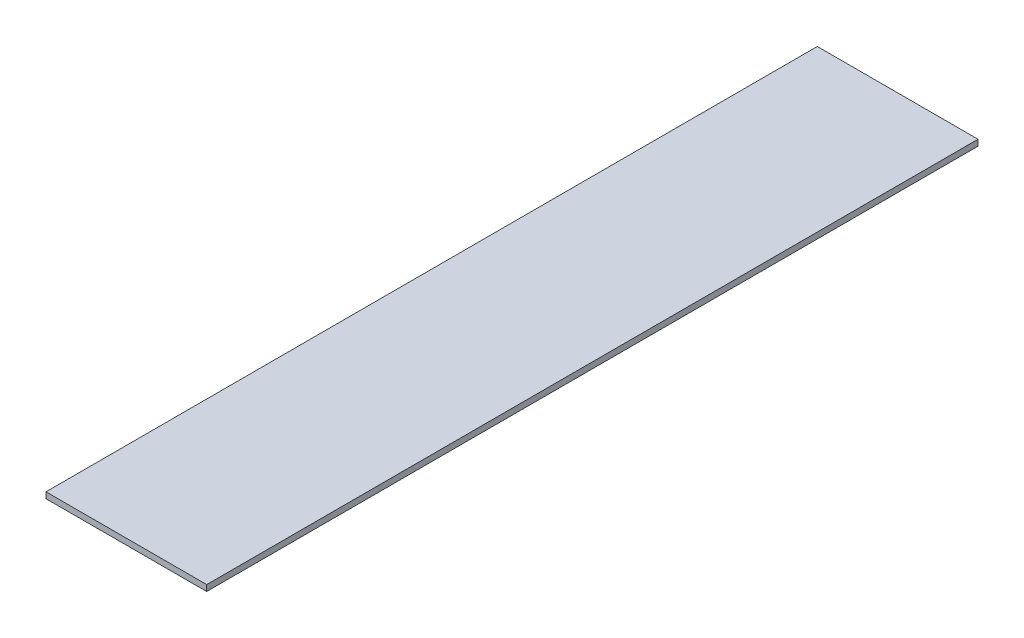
from build123d import *

# Parameters (mm, degrees)
SKETCH1_W           = 127
SKETCH1_H           = 609.6
BOSS_EXTRUDE1_DEPTH = 4.7625


with BuildPart() as part:
    # Sketch1 → Boss-Extrude1 (new body)
    with BuildSketch(Plane(origin=(0, 0, 0), x_dir=(1, 0, 0), z_dir=(0, 1, 0))):
        with Locations((63.5, 304.8)):
            Rectangle(SKETCH1_W, SKETCH1_H)
    extrude(amount=BOSS_EXTRUDE1_DEPTH)


solid = part.part
